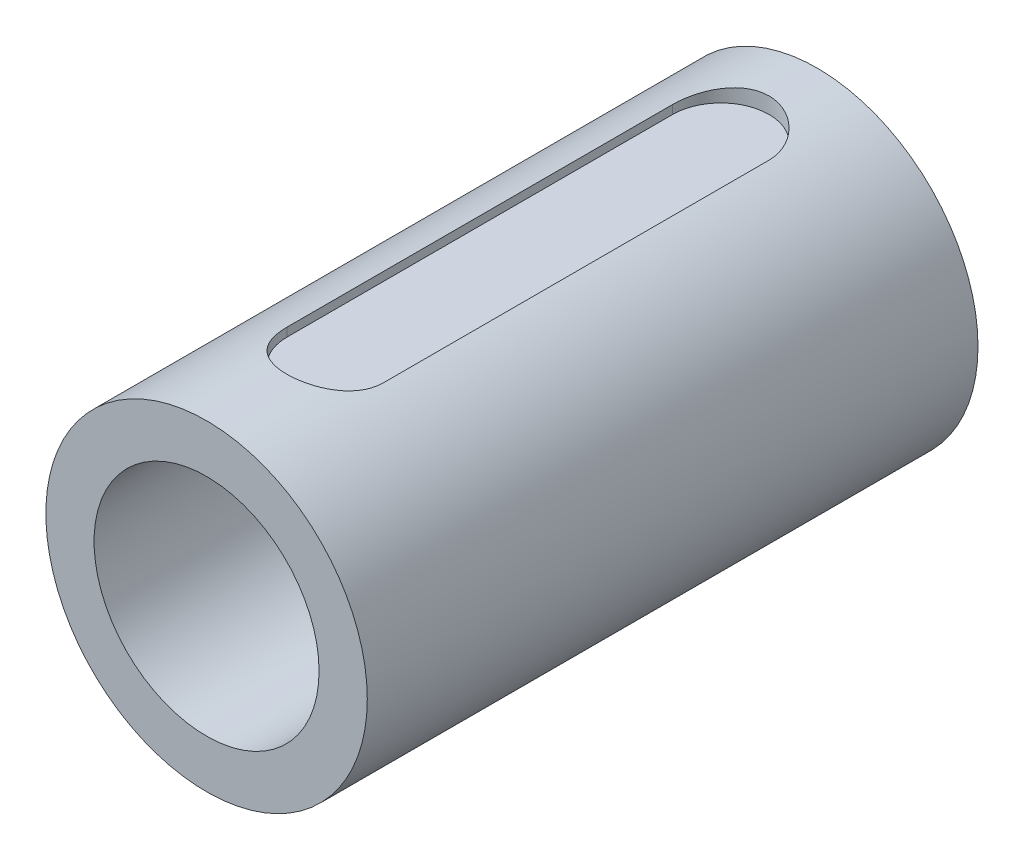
ISO-10303-21;
HEADER;
FILE_DESCRIPTION(('STEP AP214'),'2;1');
FILE_NAME('part.step','',(''),(''),'','','');
FILE_SCHEMA(('AUTOMOTIVE_DESIGN { 1 0 10303 214 1 1 1 1 }'));
ENDSEC;
DATA;
#1=APPLICATION_CONTEXT('core data for automotive mechanical design processes');
#2=APPLICATION_PROTOCOL_DEFINITION('international standard','automotive_design',2000,#1);
#3=PRODUCT_CONTEXT('',#1,'mechanical');
#4=PRODUCT('Part','Part','',(#3));
#5=PRODUCT_RELATED_PRODUCT_CATEGORY('part','',(#4));
#6=PRODUCT_DEFINITION_FORMATION('','',#4);
#7=PRODUCT_DEFINITION_CONTEXT('part definition',#1,'design');
#8=PRODUCT_DEFINITION('design','',#6,#7);
#9=PRODUCT_DEFINITION_SHAPE('','',#8);
#10=(LENGTH_UNIT() NAMED_UNIT(*) SI_UNIT(.MILLI.,.METRE.));
#11=(NAMED_UNIT(*) PLANE_ANGLE_UNIT() SI_UNIT($,.RADIAN.));
#12=(NAMED_UNIT(*) SI_UNIT($,.STERADIAN.) SOLID_ANGLE_UNIT());
#13=UNCERTAINTY_MEASURE_WITH_UNIT(LENGTH_MEASURE(1.E-05),#10,'distance_accuracy_value','');
#14=(GEOMETRIC_REPRESENTATION_CONTEXT(3) GLOBAL_UNCERTAINTY_ASSIGNED_CONTEXT((#13)) GLOBAL_UNIT_ASSIGNED_CONTEXT((#10,
#11,#12)) REPRESENTATION_CONTEXT('',''));
#15=CARTESIAN_POINT('',(0.,0.,0.));
#16=DIRECTION('',(0.,0.,1.));
#17=DIRECTION('',(1.,0.,0.));
#18=AXIS2_PLACEMENT_3D('',#15,#16,#17);
#19=CARTESIAN_POINT('',(0.,0.,-19.));
#20=DIRECTION('',(0.,0.,1.));
#21=DIRECTION('',(1.,0.,0.));
#22=AXIS2_PLACEMENT_3D('',#19,#20,#21);
#23=CYLINDRICAL_SURFACE('',#22,5.);
#24=CARTESIAN_POINT('',(0.,0.,0.));
#25=DIRECTION('',(0.,0.,1.));
#26=DIRECTION('',(1.,0.,0.));
#27=AXIS2_PLACEMENT_3D('',#24,#25,#26);
#28=CIRCLE('',#27,5.);
#29=CARTESIAN_POINT('',(5.,0.,0.));
#30=VERTEX_POINT('',#29);
#31=EDGE_CURVE('E34',#30,#30,#28,.T.);
#32=ORIENTED_EDGE('',*,*,#31,.F.);
#33=EDGE_LOOP('',(#32));
#34=FACE_BOUND('',#33,.T.);
#35=CARTESIAN_POINT('',(0.,0.,-19.));
#36=DIRECTION('',(0.,0.,1.));
#37=DIRECTION('',(1.,0.,0.));
#38=AXIS2_PLACEMENT_3D('',#35,#36,#37);
#39=CIRCLE('',#38,5.);
#40=CARTESIAN_POINT('',(5.,0.,-19.));
#41=VERTEX_POINT('',#40);
#42=EDGE_CURVE('E11',#41,#41,#39,.T.);
#43=ORIENTED_EDGE('',*,*,#42,.T.);
#44=EDGE_LOOP('',(#43));
#45=FACE_BOUND('',#44,.T.);
#46=DIRECTION('',(0.,0.,1.));
#47=VECTOR('',#46,1.);
#48=CARTESIAN_POINT('',(1.5,4.76969600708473,-19.));
#49=LINE('',#48,#47);
#50=CARTESIAN_POINT('',(1.5,4.76969600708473,-4.));
#51=VERTEX_POINT('',#50);
#52=CARTESIAN_POINT('',(1.5,4.76969600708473,-16.));
#53=VERTEX_POINT('',#52);
#54=EDGE_CURVE('E91',#51,#53,#49,.F.);
#55=ORIENTED_EDGE('',*,*,#54,.F.);
#56=CARTESIAN_POINT('',(-1.5,4.76969600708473,-4.));
#57=CARTESIAN_POINT('',(-1.50000085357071,4.76969249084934,-3.95882060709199));
#58=CARTESIAN_POINT('',(-1.49830317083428,4.77022997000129,-3.91766195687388));
#59=CARTESIAN_POINT('',(-1.49153785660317,4.77235095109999,-3.83565883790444));
#60=CARTESIAN_POINT('',(-1.48647098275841,4.77393421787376,-3.7948143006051));
#61=CARTESIAN_POINT('',(-1.46630203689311,4.78018490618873,-3.67340945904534));
#62=CARTESIAN_POINT('',(-1.44623120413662,4.78635370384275,-3.59369360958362));
#63=CARTESIAN_POINT('',(-1.39353102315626,4.80195952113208,-3.43896442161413));
#64=CARTESIAN_POINT('',(-1.36090607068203,4.81139539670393,-3.36394944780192));
#65=CARTESIAN_POINT('',(-1.28407841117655,4.83246571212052,-3.2204033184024));
#66=CARTESIAN_POINT('',(-1.23987031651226,4.84410117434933,-3.15187520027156));
#67=CARTESIAN_POINT('',(-1.13964850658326,4.86866835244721,-3.02113394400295));
#68=CARTESIAN_POINT('',(-1.08333433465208,4.88162755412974,-2.9591563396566));
#69=CARTESIAN_POINT('',(-0.961138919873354,4.90714811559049,-2.84536441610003));
#70=CARTESIAN_POINT('',(-0.895256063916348,4.91970940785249,-2.79355181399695));
#71=CARTESIAN_POINT('',(-0.75410992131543,4.94333239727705,-2.70053622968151));
#72=CARTESIAN_POINT('',(-0.678680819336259,4.95435770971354,-2.65957481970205));
#73=CARTESIAN_POINT('',(-0.521621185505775,4.97334469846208,-2.59101158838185));
#74=CARTESIAN_POINT('',(-0.439992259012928,4.98130716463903,-2.56340632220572));
#75=CARTESIAN_POINT('',(-0.275324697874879,4.99307639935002,-2.52312020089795));
#76=CARTESIAN_POINT('',(-0.192393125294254,4.99699549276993,-2.51003514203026));
#77=CARTESIAN_POINT('',(-0.0254235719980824,5.00063202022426,-2.49788265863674));
#78=CARTESIAN_POINT('',(0.0586141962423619,5.00035024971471,-2.49881258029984));
#79=CARTESIAN_POINT('',(0.222571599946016,4.99569602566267,-2.514392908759));
#80=CARTESIAN_POINT('',(0.302537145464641,4.99145415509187,-2.52860534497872));
#81=CARTESIAN_POINT('',(0.458890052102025,4.9795151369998,-2.56963163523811));
#82=CARTESIAN_POINT('',(0.535277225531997,4.97181780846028,-2.59644614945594));
#83=CARTESIAN_POINT('',(0.683347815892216,4.95365214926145,-2.66221222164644));
#84=CARTESIAN_POINT('',(0.754966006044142,4.94315255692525,-2.70130164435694));
#85=CARTESIAN_POINT('',(0.89076552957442,4.92049624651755,-2.79039859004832));
#86=CARTESIAN_POINT('',(0.954945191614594,4.90833915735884,-2.84040855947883));
#87=CARTESIAN_POINT('',(1.07665450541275,4.88311673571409,-2.95219198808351));
#88=CARTESIAN_POINT('',(1.13383351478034,4.87003445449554,-3.01434386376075));
#89=CARTESIAN_POINT('',(1.23706769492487,4.84484215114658,-3.14749742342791));
#90=CARTESIAN_POINT('',(1.28311962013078,4.83273241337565,-3.21850168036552));
#91=CARTESIAN_POINT('',(1.36316407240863,4.81077228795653,-3.36828092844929));
#92=CARTESIAN_POINT('',(1.39703006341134,4.80094596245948,-3.4471271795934));
#93=CARTESIAN_POINT('',(1.45085886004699,4.78495663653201,-3.60972450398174));
#94=CARTESIAN_POINT('',(1.47084293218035,4.77878803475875,-3.69346786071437));
#95=CARTESIAN_POINT('',(1.4890120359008,4.77314032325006,-3.81499488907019));
#96=CARTESIAN_POINT('',(1.49313202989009,4.77185156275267,-3.8518907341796));
#97=CARTESIAN_POINT('',(1.49862355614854,4.77012928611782,-3.92585147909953));
#98=CARTESIAN_POINT('',(1.49999912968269,4.76969451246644,-3.96291604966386));
#99=CARTESIAN_POINT('',(1.5,4.76969600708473,-4.));
#100=B_SPLINE_CURVE_WITH_KNOTS('',3,(#56,#57,#58,#59,#60,#61,#62,#63,#64,#65,#66,#67,#68,#69,
#70,#71,#72,#73,#74,#75,#76,#77,#78,#79,#80,#81,#82,#83,#84,#85,#86,#87,#88,#89,#90,#91,#92,#93,
#94,#95,#96,#97,#98,#99),.UNSPECIFIED.,.F.,.F.,(4,2,2,2,2,2,2,2,2,2,2,2,2,2,2,2,2,2,2,2,2,4),
(0.,0.123459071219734,0.246890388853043,0.492911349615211,0.738846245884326,0.984895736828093,
1.23795510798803,1.49105719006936,1.74939356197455,2.00766326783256,2.25854751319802,
2.5093842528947,2.75223130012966,2.99509107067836,3.2407824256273,3.48652887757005,
3.74172568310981,3.99699683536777,4.25484698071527,4.51230123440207,4.62365084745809,
4.73483637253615),.UNSPECIFIED.);
#101=CARTESIAN_POINT('',(-1.5,4.76969600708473,-4.));
#102=VERTEX_POINT('',#101);
#103=EDGE_CURVE('E75',#102,#51,#100,.T.);
#104=ORIENTED_EDGE('',*,*,#103,.F.);
#105=DIRECTION('',(0.,0.,1.));
#106=VECTOR('',#105,1.);
#107=CARTESIAN_POINT('',(-1.5,4.76969600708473,-19.));
#108=LINE('',#107,#106);
#109=CARTESIAN_POINT('',(-1.5,4.76969600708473,-16.));
#110=VERTEX_POINT('',#109);
#111=EDGE_CURVE('E86',#110,#102,#108,.T.);
#112=ORIENTED_EDGE('',*,*,#111,.F.);
#113=CARTESIAN_POINT('',(1.5,4.76969600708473,-16.));
#114=CARTESIAN_POINT('',(1.5000008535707,4.76969249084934,-16.041179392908));
#115=CARTESIAN_POINT('',(1.49830317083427,4.77022997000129,-16.0823380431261));
#116=CARTESIAN_POINT('',(1.49153785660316,4.77235095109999,-16.1643411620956));
#117=CARTESIAN_POINT('',(1.48647098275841,4.77393421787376,-16.2051856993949));
#118=CARTESIAN_POINT('',(1.46630203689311,4.78018490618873,-16.3265905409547));
#119=CARTESIAN_POINT('',(1.44623120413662,4.78635370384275,-16.4063063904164));
#120=CARTESIAN_POINT('',(1.39353102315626,4.80195952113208,-16.5610355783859));
#121=CARTESIAN_POINT('',(1.36090607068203,4.81139539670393,-16.6360505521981));
#122=CARTESIAN_POINT('',(1.28407841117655,4.83246571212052,-16.7795966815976));
#123=CARTESIAN_POINT('',(1.23987031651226,4.84410117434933,-16.8481247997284));
#124=CARTESIAN_POINT('',(1.13964850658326,4.86866835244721,-16.978866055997));
#125=CARTESIAN_POINT('',(1.08333433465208,4.88162755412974,-17.0408436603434));
#126=CARTESIAN_POINT('',(0.961138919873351,4.90714811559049,-17.1546355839));
#127=CARTESIAN_POINT('',(0.895256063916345,4.91970940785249,-17.2064481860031));
#128=CARTESIAN_POINT('',(0.754109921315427,4.94333239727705,-17.2994637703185));
#129=CARTESIAN_POINT('',(0.678680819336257,4.95435770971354,-17.340425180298));
#130=CARTESIAN_POINT('',(0.521621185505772,4.97334469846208,-17.4089884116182));
#131=CARTESIAN_POINT('',(0.439992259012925,4.98130716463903,-17.4365936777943));
#132=CARTESIAN_POINT('',(0.275324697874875,4.99307639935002,-17.4768797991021));
#133=CARTESIAN_POINT('',(0.192393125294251,4.99699549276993,-17.4899648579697));
#134=CARTESIAN_POINT('',(0.0254235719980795,5.00063202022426,-17.5021173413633));
#135=CARTESIAN_POINT('',(-0.0586141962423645,5.00035024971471,-17.5011874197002));
#136=CARTESIAN_POINT('',(-0.222571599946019,4.99569602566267,-17.485607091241));
#137=CARTESIAN_POINT('',(-0.302537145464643,4.99145415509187,-17.4713946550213));
#138=CARTESIAN_POINT('',(-0.458890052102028,4.9795151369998,-17.4303683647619));
#139=CARTESIAN_POINT('',(-0.535277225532,4.97181780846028,-17.4035538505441));
#140=CARTESIAN_POINT('',(-0.683347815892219,4.95365214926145,-17.3377877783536));
#141=CARTESIAN_POINT('',(-0.754966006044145,4.94315255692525,-17.2986983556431));
#142=CARTESIAN_POINT('',(-0.890765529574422,4.92049624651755,-17.2096014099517));
#143=CARTESIAN_POINT('',(-0.954945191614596,4.90833915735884,-17.1595914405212));
#144=CARTESIAN_POINT('',(-1.07665450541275,4.88311673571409,-17.0478080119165));
#145=CARTESIAN_POINT('',(-1.13383351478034,4.87003445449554,-16.9856561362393));
#146=CARTESIAN_POINT('',(-1.23706769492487,4.84484215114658,-16.8525025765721));
#147=CARTESIAN_POINT('',(-1.28311962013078,4.83273241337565,-16.7814983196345));
#148=CARTESIAN_POINT('',(-1.36316407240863,4.81077228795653,-16.6317190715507));
#149=CARTESIAN_POINT('',(-1.39703006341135,4.80094596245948,-16.5528728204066));
#150=CARTESIAN_POINT('',(-1.45085886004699,4.78495663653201,-16.3902754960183));
#151=CARTESIAN_POINT('',(-1.47084293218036,4.77878803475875,-16.3065321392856));
#152=CARTESIAN_POINT('',(-1.4890120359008,4.77314032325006,-16.1850051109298));
#153=CARTESIAN_POINT('',(-1.49313202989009,4.77185156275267,-16.1481092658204));
#154=CARTESIAN_POINT('',(-1.49862355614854,4.77012928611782,-16.0741485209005));
#155=CARTESIAN_POINT('',(-1.49999912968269,4.76969451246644,-16.0370839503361));
#156=CARTESIAN_POINT('',(-1.5,4.76969600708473,-16.));
#157=B_SPLINE_CURVE_WITH_KNOTS('',3,(#113,#114,#115,#116,#117,#118,#119,#120,#121,#122,#123,
#124,#125,#126,#127,#128,#129,#130,#131,#132,#133,#134,#135,#136,#137,#138,#139,#140,#141,#142,
#143,#144,#145,#146,#147,#148,#149,#150,#151,#152,#153,#154,#155,#156),.UNSPECIFIED.,.F.,.F.,(4,
2,2,2,2,2,2,2,2,2,2,2,2,2,2,2,2,2,2,2,2,4),(0.,0.123459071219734,0.246890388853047,
0.492911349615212,0.738846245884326,0.984895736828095,1.23795510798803,1.49105719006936,
1.74939356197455,2.00766326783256,2.25854751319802,2.5093842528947,2.75223130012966,
2.99509107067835,3.2407824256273,3.48652887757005,3.74172568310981,3.99699683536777,
4.25484698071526,4.51230123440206,4.62365084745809,4.73483637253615),.UNSPECIFIED.);
#158=EDGE_CURVE('E45',#53,#110,#157,.T.);
#159=ORIENTED_EDGE('',*,*,#158,.F.);
#160=EDGE_LOOP('',(#55,#104,#112,#159));
#161=FACE_BOUND('',#160,.T.);
#162=ADVANCED_FACE('F31',(#34,#45,#161),#23,.T.);
#163=CARTESIAN_POINT('',(0.,0.,-19.));
#164=DIRECTION('',(0.,0.,1.));
#165=DIRECTION('',(1.,0.,0.));
#166=AXIS2_PLACEMENT_3D('',#163,#164,#165);
#167=PLANE('',#166);
#168=CARTESIAN_POINT('',(0.,0.,-19.));
#169=DIRECTION('',(0.,0.,1.));
#170=DIRECTION('',(1.,0.,0.));
#171=AXIS2_PLACEMENT_3D('',#168,#169,#170);
#172=CIRCLE('',#171,3.5);
#173=CARTESIAN_POINT('',(3.5,0.,-19.));
#174=VERTEX_POINT('',#173);
#175=EDGE_CURVE('E139',#174,#174,#172,.T.);
#176=ORIENTED_EDGE('',*,*,#175,.T.);
#177=EDGE_LOOP('',(#176));
#178=FACE_BOUND('',#177,.T.);
#179=ORIENTED_EDGE('',*,*,#42,.F.);
#180=EDGE_LOOP('',(#179));
#181=FACE_BOUND('',#180,.T.);
#182=ADVANCED_FACE('F125',(#178,#181),#167,.F.);
#183=CARTESIAN_POINT('',(0.,0.,0.));
#184=DIRECTION('',(0.,0.,1.));
#185=DIRECTION('',(1.,0.,0.));
#186=AXIS2_PLACEMENT_3D('',#183,#184,#185);
#187=PLANE('',#186);
#188=CARTESIAN_POINT('',(0.,0.,0.));
#189=DIRECTION('',(0.,0.,1.));
#190=DIRECTION('',(1.,0.,0.));
#191=AXIS2_PLACEMENT_3D('',#188,#189,#190);
#192=CIRCLE('',#191,3.5);
#193=CARTESIAN_POINT('',(3.5,0.,0.));
#194=VERTEX_POINT('',#193);
#195=EDGE_CURVE('E89',#194,#194,#192,.T.);
#196=ORIENTED_EDGE('',*,*,#195,.F.);
#197=EDGE_LOOP('',(#196));
#198=FACE_BOUND('',#197,.T.);
#199=ORIENTED_EDGE('',*,*,#31,.T.);
#200=EDGE_LOOP('',(#199));
#201=FACE_BOUND('',#200,.T.);
#202=ADVANCED_FACE('F130',(#198,#201),#187,.T.);
#203=CARTESIAN_POINT('',(0.,0.,-19.));
#204=DIRECTION('',(0.,0.,1.));
#205=DIRECTION('',(1.,0.,0.));
#206=AXIS2_PLACEMENT_3D('',#203,#204,#205);
#207=CYLINDRICAL_SURFACE('',#206,3.5);
#208=ORIENTED_EDGE('',*,*,#175,.F.);
#209=EDGE_LOOP('',(#208));
#210=FACE_BOUND('',#209,.T.);
#211=ORIENTED_EDGE('',*,*,#195,.T.);
#212=EDGE_LOOP('',(#211));
#213=FACE_BOUND('',#212,.T.);
#214=ADVANCED_FACE('F123',(#210,#213),#207,.F.);
#215=CARTESIAN_POINT('',(0.,5.001,-4.));
#216=DIRECTION('',(0.,-1.,0.));
#217=DIRECTION('',(0.,0.,-1.));
#218=AXIS2_PLACEMENT_3D('',#215,#216,#217);
#219=CYLINDRICAL_SURFACE('',#218,1.5);
#220=ORIENTED_EDGE('',*,*,#103,.T.);
#221=DIRECTION('',(0.,-1.,0.));
#222=VECTOR('',#221,1.);
#223=CARTESIAN_POINT('',(1.5,5.001,-4.));
#224=LINE('',#223,#222);
#225=CARTESIAN_POINT('',(1.5,4.5,-4.));
#226=VERTEX_POINT('',#225);
#227=EDGE_CURVE('E53',#51,#226,#224,.T.);
#228=ORIENTED_EDGE('',*,*,#227,.T.);
#229=CARTESIAN_POINT('',(0.,4.5,-4.));
#230=DIRECTION('',(0.,1.,0.));
#231=DIRECTION('',(0.,0.,1.));
#232=AXIS2_PLACEMENT_3D('',#229,#230,#231);
#233=CIRCLE('',#232,1.5);
#234=CARTESIAN_POINT('',(-1.5,4.5,-4.));
#235=VERTEX_POINT('',#234);
#236=EDGE_CURVE('E78',#235,#226,#233,.T.);
#237=ORIENTED_EDGE('',*,*,#236,.F.);
#238=DIRECTION('',(0.,-1.,0.));
#239=VECTOR('',#238,1.);
#240=CARTESIAN_POINT('',(-1.5,5.001,-4.));
#241=LINE('',#240,#239);
#242=EDGE_CURVE('E71',#102,#235,#241,.T.);
#243=ORIENTED_EDGE('',*,*,#242,.F.);
#244=EDGE_LOOP('',(#220,#228,#237,#243));
#245=FACE_BOUND('',#244,.T.);
#246=ADVANCED_FACE('F73',(#245),#219,.F.);
#247=CARTESIAN_POINT('',(1.5,5.001,-4.));
#248=DIRECTION('',(-1.,0.,0.));
#249=DIRECTION('',(0.,0.,1.));
#250=AXIS2_PLACEMENT_3D('',#247,#248,#249);
#251=PLANE('',#250);
#252=ORIENTED_EDGE('',*,*,#54,.T.);
#253=DIRECTION('',(0.,-1.,0.));
#254=VECTOR('',#253,1.);
#255=CARTESIAN_POINT('',(1.5,5.001,-16.));
#256=LINE('',#255,#254);
#257=CARTESIAN_POINT('',(1.5,4.5,-16.));
#258=VERTEX_POINT('',#257);
#259=EDGE_CURVE('E147',#53,#258,#256,.T.);
#260=ORIENTED_EDGE('',*,*,#259,.T.);
#261=DIRECTION('',(0.,0.,-1.));
#262=VECTOR('',#261,1.);
#263=CARTESIAN_POINT('',(1.5,4.5,-4.));
#264=LINE('',#263,#262);
#265=EDGE_CURVE('E93',#226,#258,#264,.T.);
#266=ORIENTED_EDGE('',*,*,#265,.F.);
#267=ORIENTED_EDGE('',*,*,#227,.F.);
#268=EDGE_LOOP('',(#252,#260,#266,#267));
#269=FACE_BOUND('',#268,.T.);
#270=ADVANCED_FACE('F118',(#269),#251,.T.);
#271=CARTESIAN_POINT('',(0.,5.001,-16.));
#272=DIRECTION('',(0.,-1.,0.));
#273=DIRECTION('',(0.,0.,-1.));
#274=AXIS2_PLACEMENT_3D('',#271,#272,#273);
#275=CYLINDRICAL_SURFACE('',#274,1.5);
#276=ORIENTED_EDGE('',*,*,#158,.T.);
#277=DIRECTION('',(0.,-1.,0.));
#278=VECTOR('',#277,1.);
#279=CARTESIAN_POINT('',(-1.5,5.001,-16.));
#280=LINE('',#279,#278);
#281=CARTESIAN_POINT('',(-1.5,4.5,-16.));
#282=VERTEX_POINT('',#281);
#283=EDGE_CURVE('E82',#110,#282,#280,.T.);
#284=ORIENTED_EDGE('',*,*,#283,.T.);
#285=CARTESIAN_POINT('',(0.,4.5,-16.));
#286=DIRECTION('',(0.,1.,0.));
#287=DIRECTION('',(0.,0.,1.));
#288=AXIS2_PLACEMENT_3D('',#285,#286,#287);
#289=CIRCLE('',#288,1.5);
#290=EDGE_CURVE('E151',#258,#282,#289,.T.);
#291=ORIENTED_EDGE('',*,*,#290,.F.);
#292=ORIENTED_EDGE('',*,*,#259,.F.);
#293=EDGE_LOOP('',(#276,#284,#291,#292));
#294=FACE_BOUND('',#293,.T.);
#295=ADVANCED_FACE('F115',(#294),#275,.F.);
#296=CARTESIAN_POINT('',(-1.5,5.001,-16.));
#297=DIRECTION('',(1.,0.,0.));
#298=DIRECTION('',(0.,0.,-1.));
#299=AXIS2_PLACEMENT_3D('',#296,#297,#298);
#300=PLANE('',#299);
#301=ORIENTED_EDGE('',*,*,#111,.T.);
#302=ORIENTED_EDGE('',*,*,#242,.T.);
#303=DIRECTION('',(0.,0.,1.));
#304=VECTOR('',#303,1.);
#305=CARTESIAN_POINT('',(-1.5,4.5,-16.));
#306=LINE('',#305,#304);
#307=EDGE_CURVE('E83',#282,#235,#306,.T.);
#308=ORIENTED_EDGE('',*,*,#307,.F.);
#309=ORIENTED_EDGE('',*,*,#283,.F.);
#310=EDGE_LOOP('',(#301,#302,#308,#309));
#311=FACE_BOUND('',#310,.T.);
#312=ADVANCED_FACE('F87',(#311),#300,.T.);
#313=CARTESIAN_POINT('',(0.,4.5,-4.));
#314=DIRECTION('',(0.,1.,0.));
#315=DIRECTION('',(0.,0.,1.));
#316=AXIS2_PLACEMENT_3D('',#313,#314,#315);
#317=PLANE('',#316);
#318=ORIENTED_EDGE('',*,*,#236,.T.);
#319=ORIENTED_EDGE('',*,*,#265,.T.);
#320=ORIENTED_EDGE('',*,*,#290,.T.);
#321=ORIENTED_EDGE('',*,*,#307,.T.);
#322=EDGE_LOOP('',(#318,#319,#320,#321));
#323=FACE_BOUND('',#322,.T.);
#324=ADVANCED_FACE('F108',(#323),#317,.T.);
#325=CLOSED_SHELL('',(#162,#182,#202,#214,#246,#270,#295,#312,#324));
#326=MANIFOLD_SOLID_BREP('B2',#325);
#327=ADVANCED_BREP_SHAPE_REPRESENTATION('',(#18,#326),#14);
#328=SHAPE_DEFINITION_REPRESENTATION(#9,#327);
ENDSEC;
END-ISO-10303-21;
